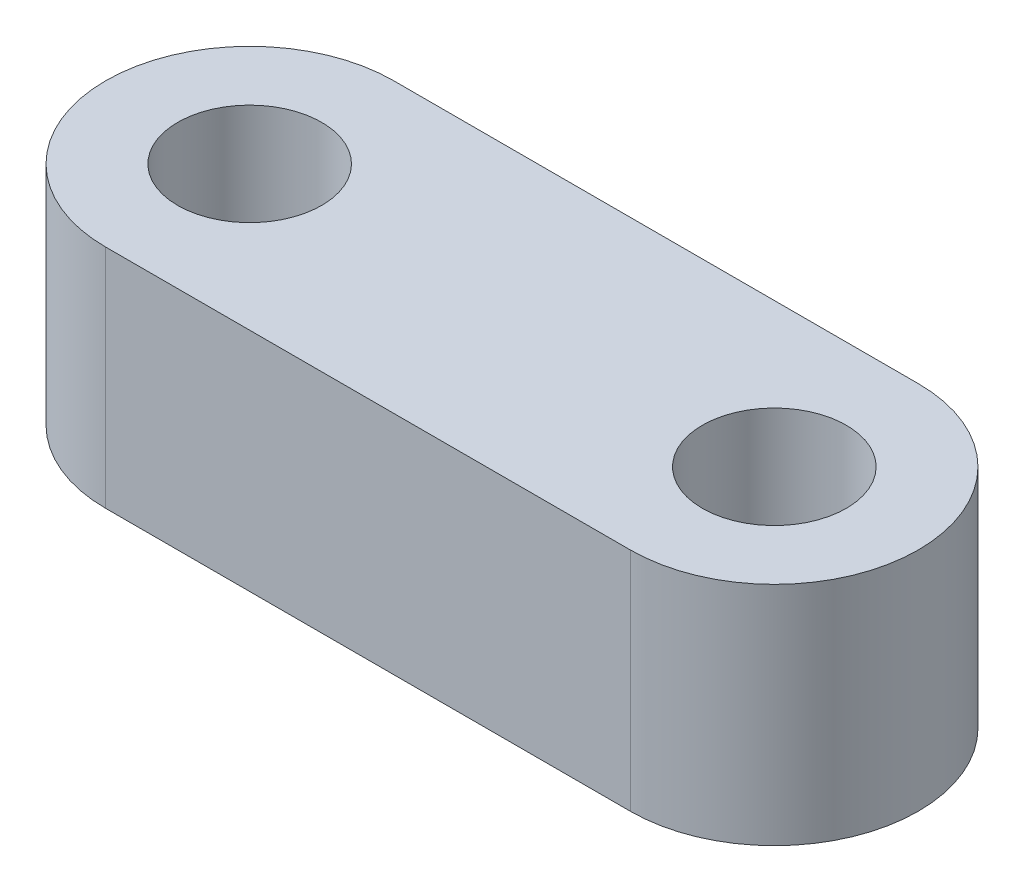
from build123d import *

# Parameters (mm, degrees)
SKETCH1_R           = 1.75
BOSS_EXTRUDE1_DEPTH = 5.5


with BuildPart() as part:
    # Sketch1 → Boss-Extrude1 (new body)
    with BuildSketch(Plane(origin=(0, 0, 0), x_dir=(1, 0, 0), z_dir=(0, 1, 0))):
        with BuildLine():
            Line((-12.75, 3.5), (0, 3.5))
            ThreePointArc((0, 3.5), (3.5, 0), (0, -3.5))
            Line((0, -3.5), (-12.75, -3.5))
            ThreePointArc((-12.75, -3.5), (-16.25, 0), (-12.75, 3.5))
        make_face()
        with Locations(Location((-12.75, 0, 0), (0, 0, 270))):
            Circle(SKETCH1_R, mode=Mode.SUBTRACT)
        with Locations(Location((0, 0, 0), (0, 0, 270))):
            Circle(SKETCH1_R, mode=Mode.SUBTRACT)
    extrude(amount=BOSS_EXTRUDE1_DEPTH)


solid = part.part
